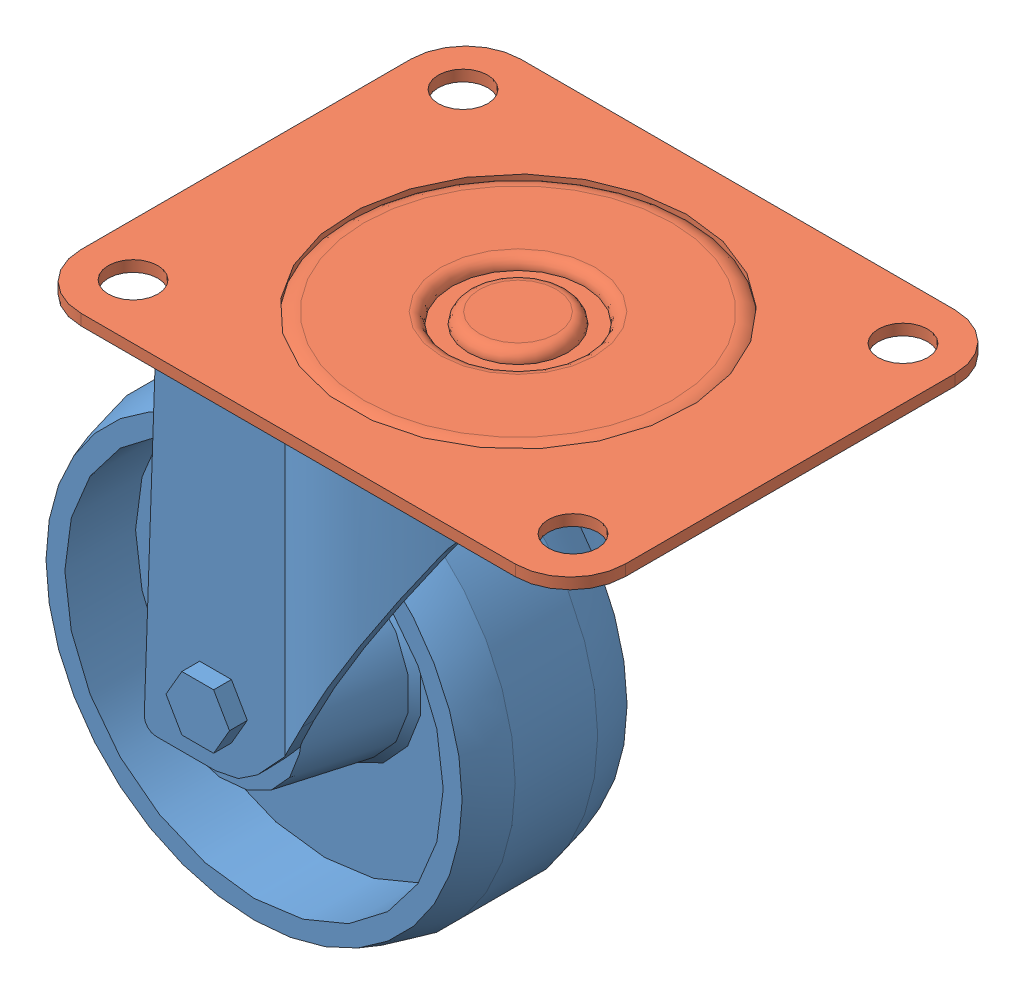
SolidWorks assembly roulette_kp3ba080-77l_Temp.SLDASM, configuration Default (file format 4100). Lengths in mm.
Overall size (122.5 107 80).
2 component instances, 2 part files, 0 mates.
Components (placement in the parent):
- roulette_kp3ba080-77l_01-1: roulette_kp3ba080-77l_01.SLDPRT [Default] at origin size (103 105 60)
- roulette_kp3ba080-77l_02-1: roulette_kp3ba080-77l_02.SLDPRT [Default] at origin size (99 9.2 80)
